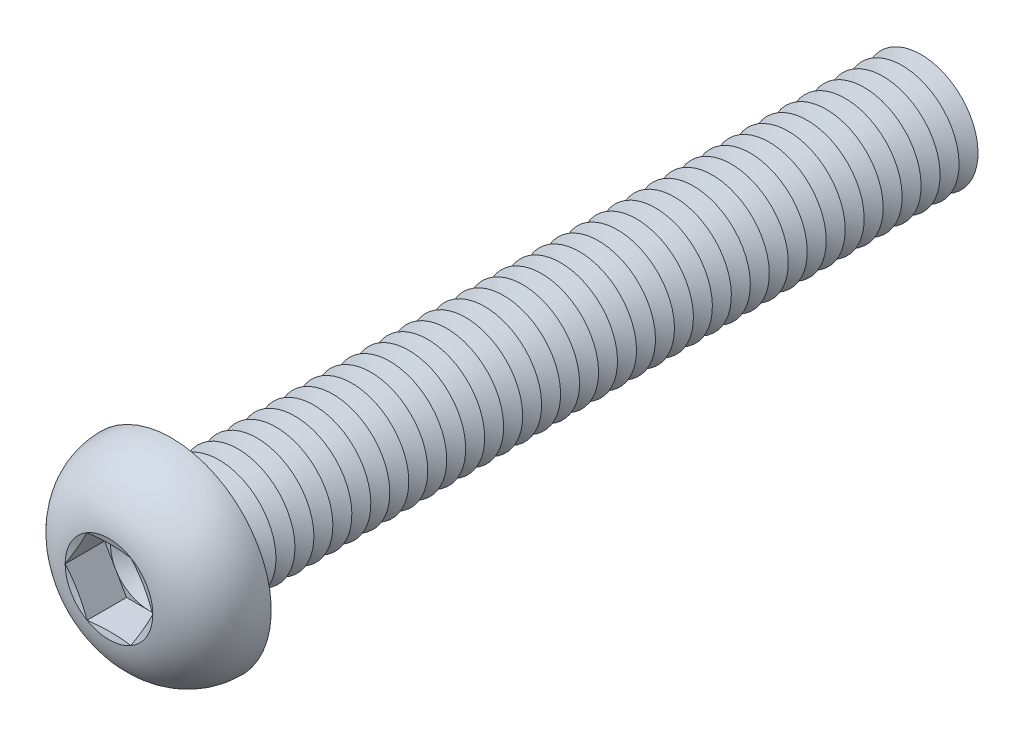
from build123d import *

# Parameters (mm, degrees)
FILLET1_R          = 0.5
LPATTERN1_COUNT    = 40
LPATTERN1_PITCH    = 1
CUT_EXTRUDE1_DEPTH = 2.08


with BuildPart() as part:
    # Sketch1 → Revolve1 (revolve)
    with BuildSketch(Plane(origin=(0, 0, 0), x_dir=(0, 0, -1), z_dir=(1, 0, 0))):
        with BuildLine():
            Line((0, 3), (0, 5.25))
            ThreePointArc((0, 5.25), (-2.210041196, 4.408189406), (-3.3, 2.3094))
            Line((-3.3, 2.3094), (-2.990599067, 1.1547))
            Line((-2.990599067, 1.1547), (-3.3, 1.1547))
            Line((-3.3, 1.1547), (-3.3, 0))
            Line((-3.3, 0), (40, 0))
            Line((40, 0), (40, 3))
            Line((40, 3), (0, 3))
        make_face()
    revolve(axis=Axis((0, 0, -40), (0, 0, 1)))

    # Fillet1
    fillet1_edges = [part.edges().sort_by_distance(p)[0] for p in [
        (0, -3, 0),
    ]]
    fillet(fillet1_edges, radius=FILLET1_R)

    # Sketch2 → Cut-Revolve1 (revolve, cut)
    with BuildSketch(Plane(origin=(0, 0, 0), x_dir=(0, 0, -1), z_dir=(1, 0, 0))):
        Polygon((39.5, 3), (40.5, 3), (40, 2.133974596), align=None)
    cut_revolve1 = revolve(axis=Axis((0, 0, -40), (0, 0, -1)), mode=Mode.SUBTRACT)

    # LPattern1: Cut-Revolve1 ×40
    with Locations(*[(0, 0, i * LPATTERN1_PITCH) for i in range(1, LPATTERN1_COUNT)]):
        add(cut_revolve1, mode=Mode.SUBTRACT)

    # Sketch3 → Cut-Extrude1 (cut)
    with BuildSketch(Plane.XY.offset(3.3)):
        Polygon((1.1547, 1.999999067), (-1.1547, 1.999999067), (-2.3094, 0), (-1.1547, -1.999999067), (1.1547, -1.999999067), (2.3094, 0), align=None)
    extrude(amount=-CUT_EXTRUDE1_DEPTH, mode=Mode.SUBTRACT)

    # Cut-Extrude2 cone 1 section (on through the dimple's axis) → Cut-Extrude2 (revolve, cut)
    with BuildSketch(Plane(origin=(0, 0, 1.22), x_dir=(0, -1, 0), z_dir=(1, 0, 0))):
        Polygon((0, 0), (1.999999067, 0), (0, 1.1547), align=None)
    revolve(axis=Axis((0, 0, 1.22), (0, 0, -1)), mode=Mode.SUBTRACT)


solid = part.part
